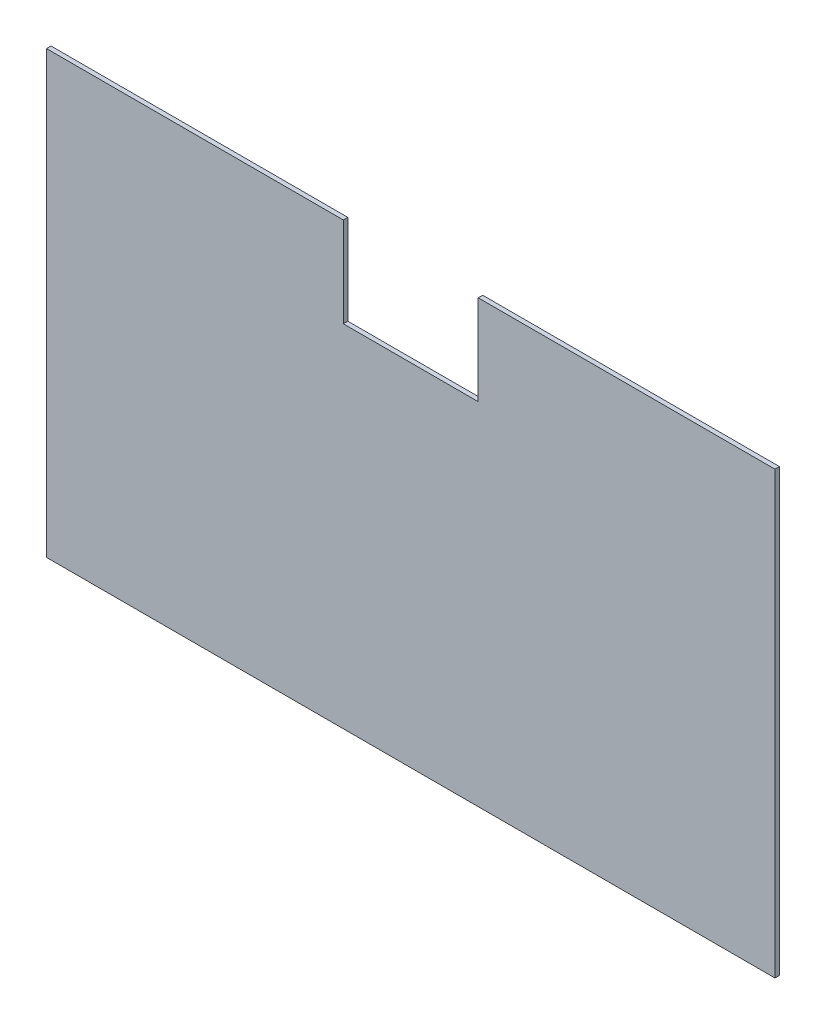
ISO-10303-21;
HEADER;
FILE_DESCRIPTION(('STEP AP214'),'2;1');
FILE_NAME('part.step','',(''),(''),'','','');
FILE_SCHEMA(('AUTOMOTIVE_DESIGN { 1 0 10303 214 1 1 1 1 }'));
ENDSEC;
DATA;
#1=APPLICATION_CONTEXT('core data for automotive mechanical design processes');
#2=APPLICATION_PROTOCOL_DEFINITION('international standard','automotive_design',2000,#1);
#3=PRODUCT_CONTEXT('',#1,'mechanical');
#4=PRODUCT('Part','Part','',(#3));
#5=PRODUCT_RELATED_PRODUCT_CATEGORY('part','',(#4));
#6=PRODUCT_DEFINITION_FORMATION('','',#4);
#7=PRODUCT_DEFINITION_CONTEXT('part definition',#1,'design');
#8=PRODUCT_DEFINITION('design','',#6,#7);
#9=PRODUCT_DEFINITION_SHAPE('','',#8);
#10=(LENGTH_UNIT() NAMED_UNIT(*) SI_UNIT(.MILLI.,.METRE.));
#11=(NAMED_UNIT(*) PLANE_ANGLE_UNIT() SI_UNIT($,.RADIAN.));
#12=(NAMED_UNIT(*) SI_UNIT($,.STERADIAN.) SOLID_ANGLE_UNIT());
#13=UNCERTAINTY_MEASURE_WITH_UNIT(LENGTH_MEASURE(1.E-05),#10,'distance_accuracy_value','');
#14=(GEOMETRIC_REPRESENTATION_CONTEXT(3) GLOBAL_UNCERTAINTY_ASSIGNED_CONTEXT((#13)) GLOBAL_UNIT_ASSIGNED_CONTEXT((#10,
#11,#12)) REPRESENTATION_CONTEXT('',''));
#15=CARTESIAN_POINT('',(0.,0.,0.));
#16=DIRECTION('',(0.,0.,1.));
#17=DIRECTION('',(1.,0.,0.));
#18=AXIS2_PLACEMENT_3D('',#15,#16,#17);
#19=CARTESIAN_POINT('',(-72.7849898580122,24.7706540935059,1.));
#20=DIRECTION('',(1.,0.,0.));
#21=DIRECTION('',(0.,1.,0.));
#22=AXIS2_PLACEMENT_3D('',#19,#20,#21);
#23=PLANE('',#22);
#24=DIRECTION('',(0.,-1.,0.));
#25=VECTOR('',#24,1.);
#26=CARTESIAN_POINT('',(-72.7849898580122,24.7706540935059,0.));
#27=LINE('',#26,#25);
#28=CARTESIAN_POINT('',(-72.7849898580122,24.7706540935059,0.));
#29=VERTEX_POINT('',#28);
#30=CARTESIAN_POINT('',(-72.7849898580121,-73.2293459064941,0.));
#31=VERTEX_POINT('',#30);
#32=EDGE_CURVE('E129',#29,#31,#27,.T.);
#33=ORIENTED_EDGE('',*,*,#32,.T.);
#34=DIRECTION('',(0.,0.,-1.));
#35=VECTOR('',#34,1.);
#36=CARTESIAN_POINT('',(-72.7849898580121,-73.2293459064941,1.));
#37=LINE('',#36,#35);
#38=CARTESIAN_POINT('',(-72.7849898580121,-73.2293459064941,1.));
#39=VERTEX_POINT('',#38);
#40=EDGE_CURVE('E11',#39,#31,#37,.T.);
#41=ORIENTED_EDGE('',*,*,#40,.F.);
#42=DIRECTION('',(0.,-1.,0.));
#43=VECTOR('',#42,1.);
#44=CARTESIAN_POINT('',(-72.7849898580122,24.7706540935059,1.));
#45=LINE('',#44,#43);
#46=CARTESIAN_POINT('',(-72.7849898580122,24.7706540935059,1.));
#47=VERTEX_POINT('',#46);
#48=EDGE_CURVE('E143',#47,#39,#45,.T.);
#49=ORIENTED_EDGE('',*,*,#48,.F.);
#50=DIRECTION('',(0.,0.,-1.));
#51=VECTOR('',#50,1.);
#52=CARTESIAN_POINT('',(-72.7849898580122,24.7706540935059,1.));
#53=LINE('',#52,#51);
#54=EDGE_CURVE('E125',#47,#29,#53,.T.);
#55=ORIENTED_EDGE('',*,*,#54,.T.);
#56=EDGE_LOOP('',(#33,#41,#49,#55));
#57=FACE_BOUND('',#56,.T.);
#58=ADVANCED_FACE('F33',(#57),#23,.F.);
#59=CARTESIAN_POINT('',(-72.7849898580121,-73.2293459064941,1.));
#60=DIRECTION('',(0.,1.,0.));
#61=DIRECTION('',(0.,0.,1.));
#62=AXIS2_PLACEMENT_3D('',#59,#60,#61);
#63=PLANE('',#62);
#64=DIRECTION('',(1.,0.,0.));
#65=VECTOR('',#64,1.);
#66=CARTESIAN_POINT('',(-72.7849898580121,-73.2293459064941,0.));
#67=LINE('',#66,#65);
#68=CARTESIAN_POINT('',(89.2150101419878,-73.2293459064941,0.));
#69=VERTEX_POINT('',#68);
#70=EDGE_CURVE('E132',#31,#69,#67,.T.);
#71=ORIENTED_EDGE('',*,*,#70,.T.);
#72=DIRECTION('',(0.,0.,-1.));
#73=VECTOR('',#72,1.);
#74=CARTESIAN_POINT('',(89.2150101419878,-73.2293459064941,1.));
#75=LINE('',#74,#73);
#76=CARTESIAN_POINT('',(89.2150101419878,-73.2293459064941,1.));
#77=VERTEX_POINT('',#76);
#78=EDGE_CURVE('E41',#77,#69,#75,.T.);
#79=ORIENTED_EDGE('',*,*,#78,.F.);
#80=DIRECTION('',(1.,0.,0.));
#81=VECTOR('',#80,1.);
#82=CARTESIAN_POINT('',(-72.7849898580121,-73.2293459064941,1.));
#83=LINE('',#82,#81);
#84=EDGE_CURVE('E92',#39,#77,#83,.T.);
#85=ORIENTED_EDGE('',*,*,#84,.F.);
#86=ORIENTED_EDGE('',*,*,#40,.T.);
#87=EDGE_LOOP('',(#71,#79,#85,#86));
#88=FACE_BOUND('',#87,.T.);
#89=ADVANCED_FACE('F178',(#88),#63,.F.);
#90=CARTESIAN_POINT('',(89.2150101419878,24.7706540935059,1.));
#91=DIRECTION('',(-1.,0.,0.));
#92=DIRECTION('',(0.,-1.,0.));
#93=AXIS2_PLACEMENT_3D('',#90,#91,#92);
#94=PLANE('',#93);
#95=DIRECTION('',(0.,1.,0.));
#96=VECTOR('',#95,1.);
#97=CARTESIAN_POINT('',(89.2150101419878,24.7706540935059,0.));
#98=LINE('',#97,#96);
#99=CARTESIAN_POINT('',(89.2150101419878,24.7706540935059,0.));
#100=VERTEX_POINT('',#99);
#101=EDGE_CURVE('E134',#69,#100,#98,.T.);
#102=ORIENTED_EDGE('',*,*,#101,.T.);
#103=DIRECTION('',(0.,0.,-1.));
#104=VECTOR('',#103,1.);
#105=CARTESIAN_POINT('',(89.2150101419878,24.7706540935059,1.));
#106=LINE('',#105,#104);
#107=CARTESIAN_POINT('',(89.2150101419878,24.7706540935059,1.));
#108=VERTEX_POINT('',#107);
#109=EDGE_CURVE('E150',#108,#100,#106,.T.);
#110=ORIENTED_EDGE('',*,*,#109,.F.);
#111=DIRECTION('',(0.,1.,0.));
#112=VECTOR('',#111,1.);
#113=CARTESIAN_POINT('',(89.2150101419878,24.7706540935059,1.));
#114=LINE('',#113,#112);
#115=EDGE_CURVE('E158',#77,#108,#114,.T.);
#116=ORIENTED_EDGE('',*,*,#115,.F.);
#117=ORIENTED_EDGE('',*,*,#78,.T.);
#118=EDGE_LOOP('',(#102,#110,#116,#117));
#119=FACE_BOUND('',#118,.T.);
#120=ADVANCED_FACE('F156',(#119),#94,.F.);
#121=CARTESIAN_POINT('',(23.2150101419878,24.7706540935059,1.));
#122=DIRECTION('',(0.,-1.,0.));
#123=DIRECTION('',(1.,0.,0.));
#124=AXIS2_PLACEMENT_3D('',#121,#122,#123);
#125=PLANE('',#124);
#126=DIRECTION('',(-1.,0.,0.));
#127=VECTOR('',#126,1.);
#128=CARTESIAN_POINT('',(23.2150101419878,24.7706540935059,0.));
#129=LINE('',#128,#127);
#130=CARTESIAN_POINT('',(23.2150101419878,24.7706540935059,0.));
#131=VERTEX_POINT('',#130);
#132=EDGE_CURVE('E136',#100,#131,#129,.T.);
#133=ORIENTED_EDGE('',*,*,#132,.T.);
#134=DIRECTION('',(0.,0.,-1.));
#135=VECTOR('',#134,1.);
#136=CARTESIAN_POINT('',(23.2150101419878,24.7706540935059,1.));
#137=LINE('',#136,#135);
#138=CARTESIAN_POINT('',(23.2150101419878,24.7706540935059,1.));
#139=VERTEX_POINT('',#138);
#140=EDGE_CURVE('E147',#139,#131,#137,.T.);
#141=ORIENTED_EDGE('',*,*,#140,.F.);
#142=DIRECTION('',(-1.,0.,0.));
#143=VECTOR('',#142,1.);
#144=CARTESIAN_POINT('',(23.2150101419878,24.7706540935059,1.));
#145=LINE('',#144,#143);
#146=EDGE_CURVE('E170',#108,#139,#145,.T.);
#147=ORIENTED_EDGE('',*,*,#146,.F.);
#148=ORIENTED_EDGE('',*,*,#109,.T.);
#149=EDGE_LOOP('',(#133,#141,#147,#148));
#150=FACE_BOUND('',#149,.T.);
#151=ADVANCED_FACE('F166',(#150),#125,.F.);
#152=CARTESIAN_POINT('',(23.2150101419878,24.7706540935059,1.));
#153=DIRECTION('',(1.,0.,0.));
#154=DIRECTION('',(0.,1.,0.));
#155=AXIS2_PLACEMENT_3D('',#152,#153,#154);
#156=PLANE('',#155);
#157=DIRECTION('',(0.,-1.,0.));
#158=VECTOR('',#157,1.);
#159=CARTESIAN_POINT('',(23.2150101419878,24.7706540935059,0.));
#160=LINE('',#159,#158);
#161=CARTESIAN_POINT('',(23.2150101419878,4.77065409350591,0.));
#162=VERTEX_POINT('',#161);
#163=EDGE_CURVE('E138',#131,#162,#160,.T.);
#164=ORIENTED_EDGE('',*,*,#163,.T.);
#165=DIRECTION('',(0.,0.,-1.));
#166=VECTOR('',#165,1.);
#167=CARTESIAN_POINT('',(23.2150101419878,4.77065409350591,1.));
#168=LINE('',#167,#166);
#169=CARTESIAN_POINT('',(23.2150101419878,4.77065409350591,1.));
#170=VERTEX_POINT('',#169);
#171=EDGE_CURVE('E120',#170,#162,#168,.T.);
#172=ORIENTED_EDGE('',*,*,#171,.F.);
#173=DIRECTION('',(0.,-1.,0.));
#174=VECTOR('',#173,1.);
#175=CARTESIAN_POINT('',(23.2150101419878,24.7706540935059,1.));
#176=LINE('',#175,#174);
#177=EDGE_CURVE('E111',#139,#170,#176,.T.);
#178=ORIENTED_EDGE('',*,*,#177,.F.);
#179=ORIENTED_EDGE('',*,*,#140,.T.);
#180=EDGE_LOOP('',(#164,#172,#178,#179));
#181=FACE_BOUND('',#180,.T.);
#182=ADVANCED_FACE('F169',(#181),#156,.F.);
#183=CARTESIAN_POINT('',(-6.78498985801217,4.77065409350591,1.));
#184=DIRECTION('',(0.,-1.,0.));
#185=DIRECTION('',(1.,0.,0.));
#186=AXIS2_PLACEMENT_3D('',#183,#184,#185);
#187=PLANE('',#186);
#188=DIRECTION('',(-1.,0.,0.));
#189=VECTOR('',#188,1.);
#190=CARTESIAN_POINT('',(-6.78498985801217,4.77065409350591,0.));
#191=LINE('',#190,#189);
#192=CARTESIAN_POINT('',(-6.78498985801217,4.77065409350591,0.));
#193=VERTEX_POINT('',#192);
#194=EDGE_CURVE('E119',#162,#193,#191,.T.);
#195=ORIENTED_EDGE('',*,*,#194,.T.);
#196=DIRECTION('',(0.,0.,-1.));
#197=VECTOR('',#196,1.);
#198=CARTESIAN_POINT('',(-6.78498985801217,4.77065409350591,1.));
#199=LINE('',#198,#197);
#200=CARTESIAN_POINT('',(-6.78498985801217,4.77065409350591,1.));
#201=VERTEX_POINT('',#200);
#202=EDGE_CURVE('E116',#201,#193,#199,.T.);
#203=ORIENTED_EDGE('',*,*,#202,.F.);
#204=DIRECTION('',(-1.,0.,0.));
#205=VECTOR('',#204,1.);
#206=CARTESIAN_POINT('',(-6.78498985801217,4.77065409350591,1.));
#207=LINE('',#206,#205);
#208=EDGE_CURVE('E105',#170,#201,#207,.T.);
#209=ORIENTED_EDGE('',*,*,#208,.F.);
#210=ORIENTED_EDGE('',*,*,#171,.T.);
#211=EDGE_LOOP('',(#195,#203,#209,#210));
#212=FACE_BOUND('',#211,.T.);
#213=ADVANCED_FACE('F117',(#212),#187,.F.);
#214=CARTESIAN_POINT('',(-6.78498985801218,24.7706540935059,1.));
#215=DIRECTION('',(-1.,0.,0.));
#216=DIRECTION('',(0.,-1.,0.));
#217=AXIS2_PLACEMENT_3D('',#214,#215,#216);
#218=PLANE('',#217);
#219=DIRECTION('',(0.,1.,0.));
#220=VECTOR('',#219,1.);
#221=CARTESIAN_POINT('',(-6.78498985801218,24.7706540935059,0.));
#222=LINE('',#221,#220);
#223=CARTESIAN_POINT('',(-6.78498985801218,24.7706540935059,0.));
#224=VERTEX_POINT('',#223);
#225=EDGE_CURVE('E78',#193,#224,#222,.T.);
#226=ORIENTED_EDGE('',*,*,#225,.T.);
#227=DIRECTION('',(0.,0.,-1.));
#228=VECTOR('',#227,1.);
#229=CARTESIAN_POINT('',(-6.78498985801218,24.7706540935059,1.));
#230=LINE('',#229,#228);
#231=CARTESIAN_POINT('',(-6.78498985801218,24.7706540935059,1.));
#232=VERTEX_POINT('',#231);
#233=EDGE_CURVE('E121',#232,#224,#230,.T.);
#234=ORIENTED_EDGE('',*,*,#233,.F.);
#235=DIRECTION('',(0.,1.,0.));
#236=VECTOR('',#235,1.);
#237=CARTESIAN_POINT('',(-6.78498985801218,24.7706540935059,1.));
#238=LINE('',#237,#236);
#239=EDGE_CURVE('E109',#201,#232,#238,.T.);
#240=ORIENTED_EDGE('',*,*,#239,.F.);
#241=ORIENTED_EDGE('',*,*,#202,.T.);
#242=EDGE_LOOP('',(#226,#234,#240,#241));
#243=FACE_BOUND('',#242,.T.);
#244=ADVANCED_FACE('F123',(#243),#218,.F.);
#245=CARTESIAN_POINT('',(-72.7849898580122,24.7706540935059,1.));
#246=DIRECTION('',(0.,-1.,0.));
#247=DIRECTION('',(0.,0.,-1.));
#248=AXIS2_PLACEMENT_3D('',#245,#246,#247);
#249=PLANE('',#248);
#250=DIRECTION('',(-1.,0.,0.));
#251=VECTOR('',#250,1.);
#252=CARTESIAN_POINT('',(-72.7849898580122,24.7706540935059,0.));
#253=LINE('',#252,#251);
#254=EDGE_CURVE('E84',#224,#29,#253,.T.);
#255=ORIENTED_EDGE('',*,*,#254,.T.);
#256=ORIENTED_EDGE('',*,*,#54,.F.);
#257=DIRECTION('',(-1.,0.,0.));
#258=VECTOR('',#257,1.);
#259=CARTESIAN_POINT('',(-72.7849898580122,24.7706540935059,1.));
#260=LINE('',#259,#258);
#261=EDGE_CURVE('E49',#232,#47,#260,.T.);
#262=ORIENTED_EDGE('',*,*,#261,.F.);
#263=ORIENTED_EDGE('',*,*,#233,.T.);
#264=EDGE_LOOP('',(#255,#256,#262,#263));
#265=FACE_BOUND('',#264,.T.);
#266=ADVANCED_FACE('F194',(#265),#249,.F.);
#267=CARTESIAN_POINT('',(0.,0.,1.));
#268=DIRECTION('',(0.,0.,1.));
#269=DIRECTION('',(1.,0.,0.));
#270=AXIS2_PLACEMENT_3D('',#267,#268,#269);
#271=PLANE('',#270);
#272=ORIENTED_EDGE('',*,*,#48,.T.);
#273=ORIENTED_EDGE('',*,*,#84,.T.);
#274=ORIENTED_EDGE('',*,*,#115,.T.);
#275=ORIENTED_EDGE('',*,*,#146,.T.);
#276=ORIENTED_EDGE('',*,*,#177,.T.);
#277=ORIENTED_EDGE('',*,*,#208,.T.);
#278=ORIENTED_EDGE('',*,*,#239,.T.);
#279=ORIENTED_EDGE('',*,*,#261,.T.);
#280=EDGE_LOOP('',(#272,#273,#274,#275,#276,#277,#278,#279));
#281=FACE_BOUND('',#280,.T.);
#282=ADVANCED_FACE('F107',(#281),#271,.T.);
#283=CARTESIAN_POINT('',(0.,0.,0.));
#284=DIRECTION('',(0.,0.,1.));
#285=DIRECTION('',(1.,0.,0.));
#286=AXIS2_PLACEMENT_3D('',#283,#284,#285);
#287=PLANE('',#286);
#288=ORIENTED_EDGE('',*,*,#32,.F.);
#289=ORIENTED_EDGE('',*,*,#254,.F.);
#290=ORIENTED_EDGE('',*,*,#225,.F.);
#291=ORIENTED_EDGE('',*,*,#194,.F.);
#292=ORIENTED_EDGE('',*,*,#163,.F.);
#293=ORIENTED_EDGE('',*,*,#132,.F.);
#294=ORIENTED_EDGE('',*,*,#101,.F.);
#295=ORIENTED_EDGE('',*,*,#70,.F.);
#296=EDGE_LOOP('',(#288,#289,#290,#291,#292,#293,#294,#295));
#297=FACE_BOUND('',#296,.T.);
#298=ADVANCED_FACE('F162',(#297),#287,.F.);
#299=CLOSED_SHELL('',(#58,#89,#120,#151,#182,#213,#244,#266,#282,#298));
#300=MANIFOLD_SOLID_BREP('B2',#299);
#301=ADVANCED_BREP_SHAPE_REPRESENTATION('',(#18,#300),#14);
#302=SHAPE_DEFINITION_REPRESENTATION(#9,#301);
ENDSEC;
END-ISO-10303-21;
